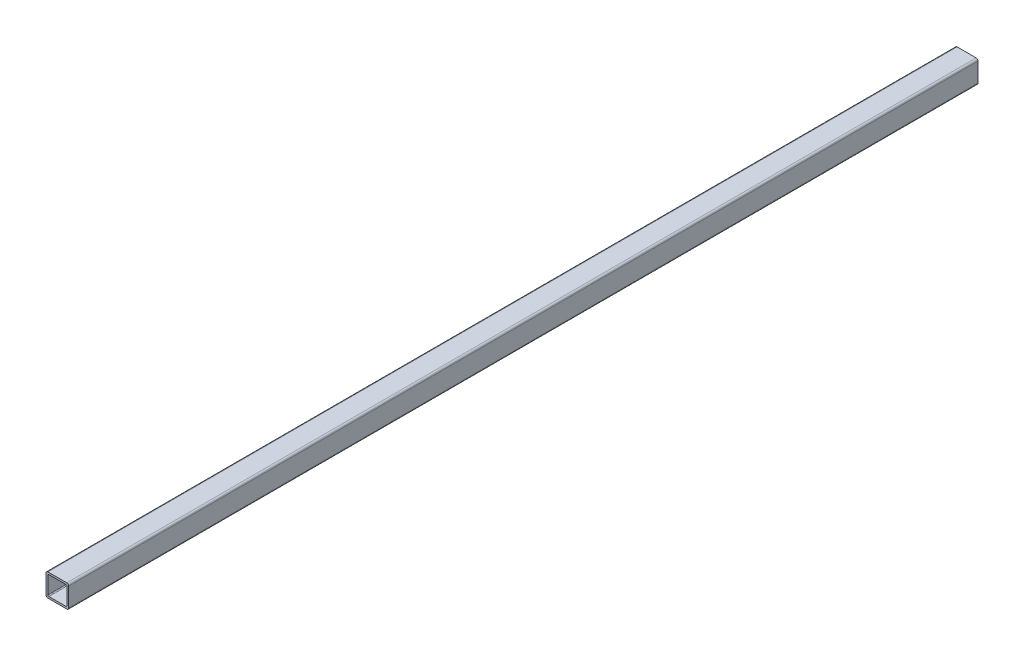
from build123d import *

# Parameters (mm, degrees)
BOSS_EXTRUDE1_DEPTH = 762


with BuildPart() as part:
    # Sketch1 → Boss-Extrude1 (new, symmetric)
    with BuildSketch(Plane.XY):
        with BuildLine():
            Line((-15.875, 19.05), (15.875, 19.05))
            ThreePointArc((15.875, 19.05), (18.12006403, 18.12006403), (19.05, 15.875))
            Line((19.05, 15.875), (19.05, -15.875))
            ThreePointArc((19.05, -15.875), (18.12006403, -18.12006403), (15.875, -19.05))
            Line((15.875, -19.05), (-15.875, -19.05))
            ThreePointArc((-15.875, -19.05), (-18.12006403, -18.12006403), (-19.05, -15.875))
            Line((-19.05, -15.875), (-19.05, 15.875))
            ThreePointArc((-19.05, 15.875), (-18.12006403, 18.12006403), (-15.875, 19.05))
        make_face()
        with BuildLine():
            Line((-14.2875, 15.875), (14.2875, 15.875))
            ThreePointArc((14.2875, 15.875), (15.410032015, 15.410032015), (15.875, 14.2875))
            Line((15.875, 14.2875), (15.875, -14.2875))
            ThreePointArc((15.875, -14.2875), (15.410032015, -15.410032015), (14.2875, -15.875))
            Line((14.2875, -15.875), (-14.2875, -15.875))
            ThreePointArc((-14.2875, -15.875), (-15.410032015, -15.410032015), (-15.875, -14.2875))
            Line((-15.875, -14.2875), (-15.875, 14.2875))
            ThreePointArc((-15.875, 14.2875), (-15.410032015, 15.410032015), (-14.2875, 15.875))
        make_face(mode=Mode.SUBTRACT)
    extrude(amount=BOSS_EXTRUDE1_DEPTH, both=True)


solid = part.part
